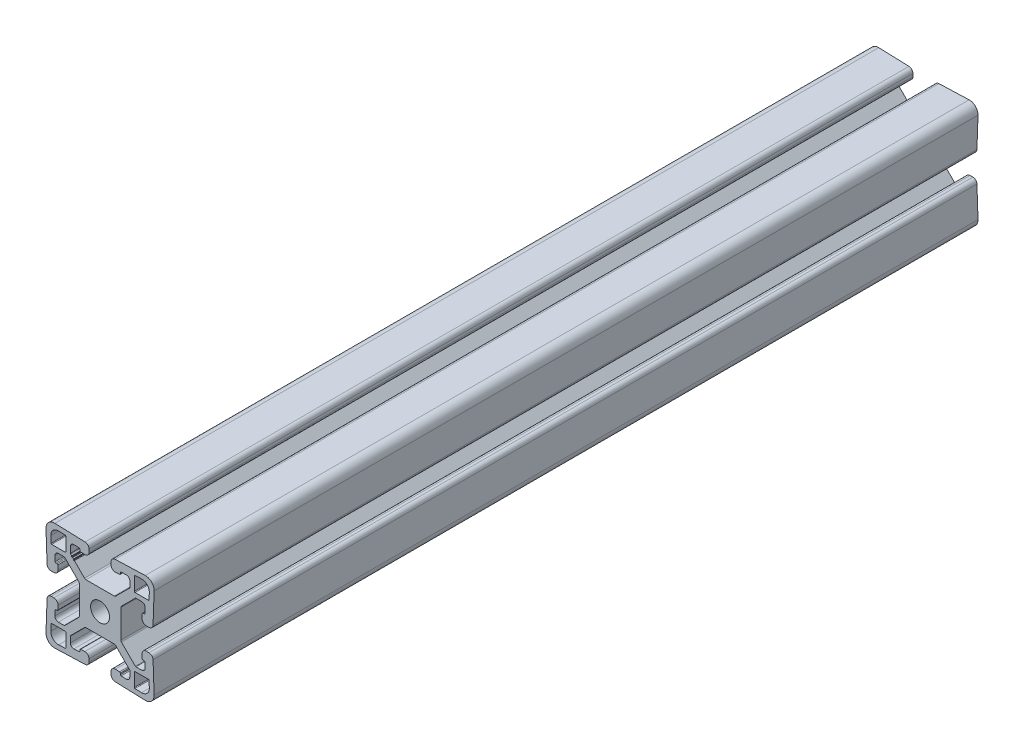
from build123d import *

# Parameters (mm, degrees)
BOSS_EXTRUDE1_DEPTH     = 152.4
CIRPATTERN1_COUNT       = 4
CUT_EXTRUDE1_DEPTH      = 156.002451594
CUT_EXTRUDE1_DEPTH_BACK = 156.002451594


with BuildPart() as part:
    # Sketch3 → Boss-Extrude1 (new, symmetric)
    with BuildSketch(Plane.XY):
        with BuildLine():
            Line((-7.681, 0), (-7.681, 5.210107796))
            ThreePointArc((-7.681, 5.210107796), (-7.739003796, 5.501712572), (-7.904184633, 5.748923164))
            Line((-7.904184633, 5.748923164), (-13.062267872, 10.907006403))
            ThreePointArc((-13.062267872, 10.907006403), (-13.165272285, 10.975831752), (-13.286774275, 11))
            Line((-13.286774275, 11), (-15.433540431, 11))
            ThreePointArc((-15.433540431, 11), (-16.347101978, 10.61221613), (-16.702766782, 9.685677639))
            Line((-16.702766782, 9.685677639), (-16.637141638, 7.80641941))
            ThreePointArc((-16.637141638, 7.80641941), (-16.540389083, 7.589109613), (-16.319835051, 7.5))
            Line((-16.319835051, 7.5), (-15.916428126, 7.5))
            ThreePointArc((-15.916428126, 7.5), (-15.695874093, 7.410890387), (-15.599121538, 7.19358059))
            Line((-15.599121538, 7.19358059), (-15.544946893, 5.642221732))
            ThreePointArc((-15.544946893, 5.642221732), (-15.972024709, 4.529645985), (-17.069017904, 4.064))
            Line((-17.069017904, 4.064), (-18.083635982, 4.064))
            ThreePointArc((-18.083635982, 4.064), (-19.142989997, 4.492006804), (-19.607706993, 5.535778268))
            Line((-19.607706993, 5.535778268), (-19.998065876, 16.714194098))
            ThreePointArc((-19.998065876, 16.714194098), (-19.07006403, 19.07006403), (-16.714194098, 19.998065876))
            Line((-16.714194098, 19.998065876), (-5.535778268, 19.607706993))
            ThreePointArc((-5.535778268, 19.607706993), (-4.492006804, 19.142989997), (-4.064, 18.083635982))
            Line((-4.064, 18.083635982), (-4.064, 17.069017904))
            ThreePointArc((-4.064, 17.069017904), (-4.529645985, 15.972024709), (-5.642221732, 15.544946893))
            Line((-5.642221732, 15.544946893), (-7.19358059, 15.599121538))
            ThreePointArc((-7.19358059, 15.599121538), (-7.410890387, 15.695874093), (-7.5, 15.916428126))
            Line((-7.5, 15.916428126), (-7.5, 16.319835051))
            ThreePointArc((-7.5, 16.319835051), (-7.589109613, 16.540389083), (-7.80641941, 16.637141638))
            Line((-7.80641941, 16.637141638), (-9.685677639, 16.702766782))
            ThreePointArc((-9.685677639, 16.702766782), (-10.61221613, 16.347101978), (-11, 15.433540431))
            Line((-11, 15.433540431), (-11, 13.286774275))
            ThreePointArc((-11, 13.286774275), (-10.975831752, 13.165272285), (-10.907006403, 13.062267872))
            Line((-10.907006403, 13.062267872), (-5.748923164, 7.904184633))
            ThreePointArc((-5.748923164, 7.904184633), (-5.501712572, 7.739003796), (-5.210107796, 7.681))
            Line((-5.210107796, 7.681), (0, 7.681))
            Line((0, 7.681), (0, 3.5))
            ThreePointArc((0, 3.5), (-2.474873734, 2.474873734), (-3.5, 0))
            Line((-3.5, 0), (-7.681, 0))
        make_face()
        with BuildLine():
            Line((-18.220706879, 15.330899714), (-18.136032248, 12.906135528))
            ThreePointArc((-18.136032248, 12.906135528), (-18.058630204, 12.732287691), (-17.882186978, 12.661))
            Line((-17.882186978, 12.661), (-12.915, 12.661))
            ThreePointArc((-12.915, 12.661), (-12.735394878, 12.735394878), (-12.661, 12.915))
            Line((-12.661, 12.915), (-12.661, 17.882186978))
            ThreePointArc((-12.661, 17.882186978), (-12.732287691, 18.058630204), (-12.906135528, 18.136032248))
            Line((-12.906135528, 18.136032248), (-15.330899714, 18.220706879))
            ThreePointArc((-15.330899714, 18.220706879), (-17.404065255, 17.404065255), (-18.220706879, 15.330899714))
        make_face(mode=Mode.SUBTRACT)
    boss_extrude1 = extrude(amount=BOSS_EXTRUDE1_DEPTH, both=True)

    # CirPattern1: Boss-Extrude1 ×4 about axis
    cirpattern1_axis = Axis((0, 0, 0), (0, 0, 1))
    for i in range(1, CIRPATTERN1_COUNT):
        add(boss_extrude1.rotate(cirpattern1_axis, i * 360 / CIRPATTERN1_COUNT))

    # Sketch4 → Cut-Extrude1 (cut, two sides: drawn at the far end of the back side and taken through both)
    with BuildSketch(Plane.XY.offset(-CUT_EXTRUDE1_DEPTH_BACK)):
        Polygon((-10.505738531, 12.661), (-9.505738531, 12.661), (-9.505738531, 11.661), (-9.839071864, 11.661), (-9.839071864, 11.994333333), (-10.172405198, 12.327666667), (-10.505738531, 12.327666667), align=None)
    extrude(amount=CUT_EXTRUDE1_DEPTH + CUT_EXTRUDE1_DEPTH_BACK, mode=Mode.SUBTRACT)


solid = part.part
